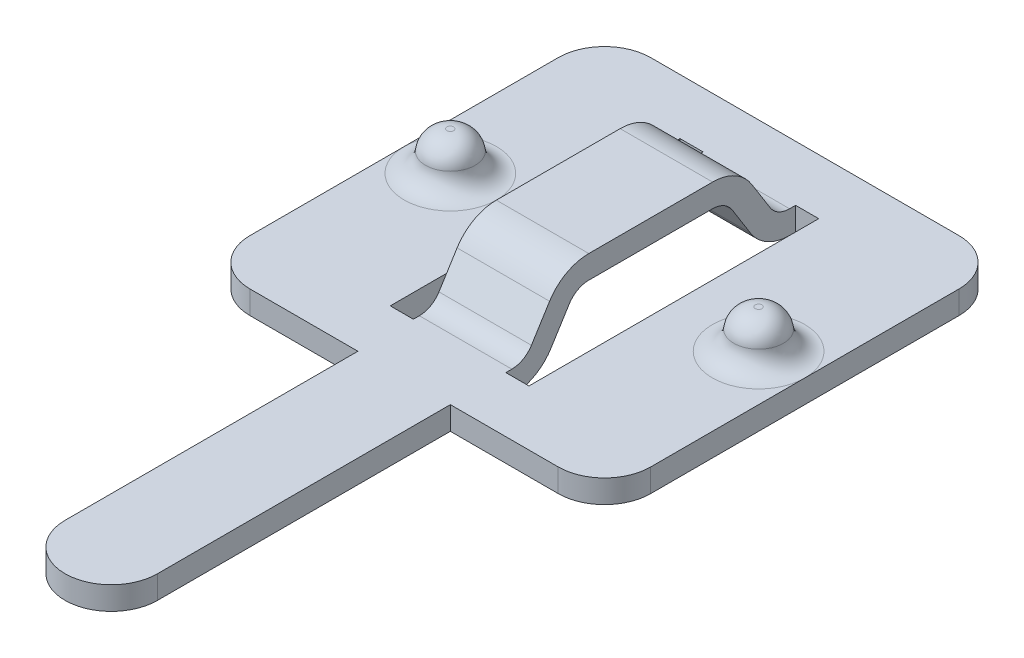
ISO-10303-21;
HEADER;
FILE_DESCRIPTION(('STEP AP214'),'2;1');
FILE_NAME('part.step','',(''),(''),'','','');
FILE_SCHEMA(('AUTOMOTIVE_DESIGN { 1 0 10303 214 1 1 1 1 }'));
ENDSEC;
DATA;
#1=APPLICATION_CONTEXT('core data for automotive mechanical design processes');
#2=APPLICATION_PROTOCOL_DEFINITION('international standard','automotive_design',2000,#1);
#3=PRODUCT_CONTEXT('',#1,'mechanical');
#4=PRODUCT('Part','Part','',(#3));
#5=PRODUCT_RELATED_PRODUCT_CATEGORY('part','',(#4));
#6=PRODUCT_DEFINITION_FORMATION('','',#4);
#7=PRODUCT_DEFINITION_CONTEXT('part definition',#1,'design');
#8=PRODUCT_DEFINITION('design','',#6,#7);
#9=PRODUCT_DEFINITION_SHAPE('','',#8);
#10=(LENGTH_UNIT() NAMED_UNIT(*) SI_UNIT(.MILLI.,.METRE.));
#11=(NAMED_UNIT(*) PLANE_ANGLE_UNIT() SI_UNIT($,.RADIAN.));
#12=(NAMED_UNIT(*) SI_UNIT($,.STERADIAN.) SOLID_ANGLE_UNIT());
#13=UNCERTAINTY_MEASURE_WITH_UNIT(LENGTH_MEASURE(1.E-05),#10,'distance_accuracy_value','');
#14=(GEOMETRIC_REPRESENTATION_CONTEXT(3) GLOBAL_UNCERTAINTY_ASSIGNED_CONTEXT((#13)) GLOBAL_UNIT_ASSIGNED_CONTEXT((#10,
#11,#12)) REPRESENTATION_CONTEXT('',''));
#15=CARTESIAN_POINT('',(0.,0.,0.));
#16=DIRECTION('',(0.,0.,1.));
#17=DIRECTION('',(1.,0.,0.));
#18=AXIS2_PLACEMENT_3D('',#15,#16,#17);
#19=CARTESIAN_POINT('',(2.75,0.75,4.7));
#20=DIRECTION('',(0.,0.,-1.));
#21=DIRECTION('',(-1.,0.,0.));
#22=AXIS2_PLACEMENT_3D('',#19,#20,#21);
#23=PLANE('',#22);
#24=DIRECTION('',(1.,0.,0.));
#25=VECTOR('',#24,1.);
#26=CARTESIAN_POINT('',(2.75,0.,4.7));
#27=LINE('',#26,#25);
#28=CARTESIAN_POINT('',(6.5,0.,4.7));
#29=VERTEX_POINT('',#28);
#30=CARTESIAN_POINT('',(7.25,0.,4.7));
#31=VERTEX_POINT('',#30);
#32=EDGE_CURVE('E52',#29,#31,#27,.T.);
#33=ORIENTED_EDGE('',*,*,#32,.F.);
#34=DIRECTION('',(0.,-1.,0.));
#35=VECTOR('',#34,1.);
#36=CARTESIAN_POINT('',(6.5,0.,4.7));
#37=LINE('',#36,#35);
#38=CARTESIAN_POINT('',(6.5,0.75,4.7));
#39=VERTEX_POINT('',#38);
#40=EDGE_CURVE('E47',#39,#29,#37,.T.);
#41=ORIENTED_EDGE('',*,*,#40,.F.);
#42=DIRECTION('',(1.,0.,0.));
#43=VECTOR('',#42,1.);
#44=CARTESIAN_POINT('',(2.75,0.75,4.7));
#45=LINE('',#44,#43);
#46=CARTESIAN_POINT('',(7.25,0.75,4.7));
#47=VERTEX_POINT('',#46);
#48=EDGE_CURVE('E457',#39,#47,#45,.T.);
#49=ORIENTED_EDGE('',*,*,#48,.T.);
#50=DIRECTION('',(0.,-1.,0.));
#51=VECTOR('',#50,1.);
#52=CARTESIAN_POINT('',(7.25,0.75,4.7));
#53=LINE('',#52,#51);
#54=EDGE_CURVE('E470',#47,#31,#53,.T.);
#55=ORIENTED_EDGE('',*,*,#54,.T.);
#56=EDGE_LOOP('',(#33,#41,#49,#55));
#57=FACE_BOUND('',#56,.T.);
#58=ADVANCED_FACE('F32',(#57),#23,.T.);
#59=CARTESIAN_POINT('',(2.75,0.75,-4.7));
#60=DIRECTION('',(0.,0.,1.));
#61=DIRECTION('',(1.,0.,0.));
#62=AXIS2_PLACEMENT_3D('',#59,#60,#61);
#63=PLANE('',#62);
#64=DIRECTION('',(-1.,0.,0.));
#65=VECTOR('',#64,1.);
#66=CARTESIAN_POINT('',(2.75,0.75,-4.7));
#67=LINE('',#66,#65);
#68=CARTESIAN_POINT('',(7.25,0.75,-4.7));
#69=VERTEX_POINT('',#68);
#70=CARTESIAN_POINT('',(6.5,0.75,-4.7));
#71=VERTEX_POINT('',#70);
#72=EDGE_CURVE('E463',#69,#71,#67,.T.);
#73=ORIENTED_EDGE('',*,*,#72,.T.);
#74=DIRECTION('',(0.,1.,0.));
#75=VECTOR('',#74,1.);
#76=CARTESIAN_POINT('',(6.5,0.75,-4.7));
#77=LINE('',#76,#75);
#78=CARTESIAN_POINT('',(6.5,0.,-4.7));
#79=VERTEX_POINT('',#78);
#80=EDGE_CURVE('E335',#79,#71,#77,.T.);
#81=ORIENTED_EDGE('',*,*,#80,.F.);
#82=DIRECTION('',(-1.,0.,0.));
#83=VECTOR('',#82,1.);
#84=CARTESIAN_POINT('',(2.75,0.,-4.7));
#85=LINE('',#84,#83);
#86=CARTESIAN_POINT('',(7.25,0.,-4.7));
#87=VERTEX_POINT('',#86);
#88=EDGE_CURVE('E452',#87,#79,#85,.T.);
#89=ORIENTED_EDGE('',*,*,#88,.F.);
#90=DIRECTION('',(0.,-1.,0.));
#91=VECTOR('',#90,1.);
#92=CARTESIAN_POINT('',(7.25,0.75,-4.7));
#93=LINE('',#92,#91);
#94=EDGE_CURVE('E468',#69,#87,#93,.T.);
#95=ORIENTED_EDGE('',*,*,#94,.F.);
#96=EDGE_LOOP('',(#73,#81,#89,#95));
#97=FACE_BOUND('',#96,.T.);
#98=ADVANCED_FACE('F601',(#97),#63,.T.);
#99=CARTESIAN_POINT('',(5.,0.75,16.));
#100=DIRECTION('',(0.,1.,0.));
#101=DIRECTION('',(0.,0.,1.));
#102=AXIS2_PLACEMENT_3D('',#99,#100,#101);
#103=PLANE('',#102);
#104=DIRECTION('',(0.,0.,-1.));
#105=VECTOR('',#104,1.);
#106=CARTESIAN_POINT('',(11.5,0.75,-4.99999999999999));
#107=LINE('',#106,#105);
#108=CARTESIAN_POINT('',(11.5,0.75,4.99999999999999));
#109=VERTEX_POINT('',#108);
#110=CARTESIAN_POINT('',(11.5,0.75,0.));
#111=VERTEX_POINT('',#110);
#112=EDGE_CURVE('E518',#109,#111,#107,.T.);
#113=ORIENTED_EDGE('',*,*,#112,.T.);
#114=CARTESIAN_POINT('',(10.,0.75,0.));
#115=DIRECTION('',(0.,-1.,0.));
#116=DIRECTION('',(0.,0.,-1.));
#117=AXIS2_PLACEMENT_3D('',#114,#115,#116);
#118=CIRCLE('',#117,1.5);
#119=EDGE_CURVE('E424',#111,#111,#118,.T.);
#120=ORIENTED_EDGE('',*,*,#119,.T.);
#121=CARTESIAN_POINT('',(11.5,0.75,-4.99999999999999));
#122=VERTEX_POINT('',#121);
#123=EDGE_CURVE('E517',#111,#122,#107,.T.);
#124=ORIENTED_EDGE('',*,*,#123,.T.);
#125=CARTESIAN_POINT('',(10.,0.75,-5.));
#126=DIRECTION('',(0.,1.,0.));
#127=DIRECTION('',(0.,0.,-1.));
#128=AXIS2_PLACEMENT_3D('',#125,#126,#127);
#129=CIRCLE('',#128,1.5);
#130=CARTESIAN_POINT('',(9.99999999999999,0.75,-6.5));
#131=VERTEX_POINT('',#130);
#132=EDGE_CURVE('E520',#122,#131,#129,.T.);
#133=ORIENTED_EDGE('',*,*,#132,.T.);
#134=DIRECTION('',(-1.,0.,0.));
#135=VECTOR('',#134,1.);
#136=CARTESIAN_POINT('',(0.,0.75,-6.5));
#137=LINE('',#136,#135);
#138=CARTESIAN_POINT('',(0.,0.75,-6.5));
#139=VERTEX_POINT('',#138);
#140=EDGE_CURVE('E522',#131,#139,#137,.T.);
#141=ORIENTED_EDGE('',*,*,#140,.T.);
#142=CARTESIAN_POINT('',(0.,0.75,-5.));
#143=DIRECTION('',(0.,1.,0.));
#144=DIRECTION('',(0.,0.,1.));
#145=AXIS2_PLACEMENT_3D('',#142,#143,#144);
#146=CIRCLE('',#145,1.5);
#147=CARTESIAN_POINT('',(-1.5,0.75,-4.99999999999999));
#148=VERTEX_POINT('',#147);
#149=EDGE_CURVE('E524',#139,#148,#146,.T.);
#150=ORIENTED_EDGE('',*,*,#149,.T.);
#151=DIRECTION('',(0.,0.,1.));
#152=VECTOR('',#151,1.);
#153=CARTESIAN_POINT('',(-1.5,0.75,-4.99999999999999));
#154=LINE('',#153,#152);
#155=CARTESIAN_POINT('',(-1.5,0.75,0.));
#156=VERTEX_POINT('',#155);
#157=EDGE_CURVE('E527',#148,#156,#154,.T.);
#158=ORIENTED_EDGE('',*,*,#157,.T.);
#159=CARTESIAN_POINT('',(0.,0.75,0.));
#160=DIRECTION('',(0.,-1.,0.));
#161=DIRECTION('',(0.,0.,-1.));
#162=AXIS2_PLACEMENT_3D('',#159,#160,#161);
#163=CIRCLE('',#162,1.5);
#164=EDGE_CURVE('E436',#156,#156,#163,.T.);
#165=ORIENTED_EDGE('',*,*,#164,.T.);
#166=CARTESIAN_POINT('',(-1.5,0.75,4.99999999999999));
#167=VERTEX_POINT('',#166);
#168=EDGE_CURVE('E526',#156,#167,#154,.T.);
#169=ORIENTED_EDGE('',*,*,#168,.T.);
#170=CARTESIAN_POINT('',(0.,0.75,5.));
#171=DIRECTION('',(0.,1.,0.));
#172=DIRECTION('',(0.,0.,1.));
#173=AXIS2_PLACEMENT_3D('',#170,#171,#172);
#174=CIRCLE('',#173,1.5);
#175=CARTESIAN_POINT('',(0.,0.75,6.5));
#176=VERTEX_POINT('',#175);
#177=EDGE_CURVE('E529',#167,#176,#174,.T.);
#178=ORIENTED_EDGE('',*,*,#177,.T.);
#179=DIRECTION('',(1.,0.,0.));
#180=VECTOR('',#179,1.);
#181=CARTESIAN_POINT('',(0.,0.75,6.5));
#182=LINE('',#181,#180);
#183=CARTESIAN_POINT('',(3.5,0.75,6.5));
#184=VERTEX_POINT('',#183);
#185=EDGE_CURVE('E531',#176,#184,#182,.T.);
#186=ORIENTED_EDGE('',*,*,#185,.T.);
#187=DIRECTION('',(0.,0.,1.));
#188=VECTOR('',#187,1.);
#189=CARTESIAN_POINT('',(3.5,0.75,6.5));
#190=LINE('',#189,#188);
#191=CARTESIAN_POINT('',(3.5,0.75,16.));
#192=VERTEX_POINT('',#191);
#193=EDGE_CURVE('E506',#184,#192,#190,.T.);
#194=ORIENTED_EDGE('',*,*,#193,.T.);
#195=CARTESIAN_POINT('',(5.,0.75,16.));
#196=DIRECTION('',(0.,1.,0.));
#197=DIRECTION('',(0.,0.,1.));
#198=AXIS2_PLACEMENT_3D('',#195,#196,#197);
#199=CIRCLE('',#198,1.5);
#200=CARTESIAN_POINT('',(6.5,0.75,16.));
#201=VERTEX_POINT('',#200);
#202=EDGE_CURVE('E509',#192,#201,#199,.T.);
#203=ORIENTED_EDGE('',*,*,#202,.T.);
#204=DIRECTION('',(0.,0.,-1.));
#205=VECTOR('',#204,1.);
#206=CARTESIAN_POINT('',(6.5,0.75,6.5));
#207=LINE('',#206,#205);
#208=CARTESIAN_POINT('',(6.5,0.75,6.5));
#209=VERTEX_POINT('',#208);
#210=EDGE_CURVE('E511',#201,#209,#207,.T.);
#211=ORIENTED_EDGE('',*,*,#210,.T.);
#212=DIRECTION('',(1.,0.,0.));
#213=VECTOR('',#212,1.);
#214=CARTESIAN_POINT('',(6.5,0.75,6.5));
#215=LINE('',#214,#213);
#216=CARTESIAN_POINT('',(9.99999999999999,0.75,6.5));
#217=VERTEX_POINT('',#216);
#218=EDGE_CURVE('E513',#209,#217,#215,.T.);
#219=ORIENTED_EDGE('',*,*,#218,.T.);
#220=CARTESIAN_POINT('',(10.,0.75,5.));
#221=DIRECTION('',(0.,1.,0.));
#222=DIRECTION('',(0.,0.,1.));
#223=AXIS2_PLACEMENT_3D('',#220,#221,#222);
#224=CIRCLE('',#223,1.5);
#225=EDGE_CURVE('E515',#217,#109,#224,.T.);
#226=ORIENTED_EDGE('',*,*,#225,.T.);
#227=EDGE_LOOP('',(#113,#120,#124,#133,#141,#150,#158,#165,#169,#178,#186,#194,#203,#211,#219,#226));
#228=FACE_BOUND('',#227,.T.);
#229=CARTESIAN_POINT('',(2.75,0.75,4.7));
#230=VERTEX_POINT('',#229);
#231=CARTESIAN_POINT('',(3.5,0.75,4.7));
#232=VERTEX_POINT('',#231);
#233=EDGE_CURVE('E458',#230,#232,#45,.T.);
#234=ORIENTED_EDGE('',*,*,#233,.F.);
#235=DIRECTION('',(0.,0.,1.));
#236=VECTOR('',#235,1.);
#237=CARTESIAN_POINT('',(2.75,0.75,-4.7));
#238=LINE('',#237,#236);
#239=CARTESIAN_POINT('',(2.75,0.75,-4.7));
#240=VERTEX_POINT('',#239);
#241=EDGE_CURVE('E455',#240,#230,#238,.T.);
#242=ORIENTED_EDGE('',*,*,#241,.F.);
#243=CARTESIAN_POINT('',(3.5,0.75,-4.7));
#244=VERTEX_POINT('',#243);
#245=EDGE_CURVE('E278',#244,#240,#67,.T.);
#246=ORIENTED_EDGE('',*,*,#245,.F.);
#247=DIRECTION('',(0.,0.,1.));
#248=VECTOR('',#247,1.);
#249=CARTESIAN_POINT('',(3.5,0.75,-4.50573178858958));
#250=LINE('',#249,#248);
#251=CARTESIAN_POINT('',(3.5,0.75,-4.50573178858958));
#252=VERTEX_POINT('',#251);
#253=EDGE_CURVE('E270',#244,#252,#250,.T.);
#254=ORIENTED_EDGE('',*,*,#253,.T.);
#255=DIRECTION('',(-1.,0.,0.));
#256=VECTOR('',#255,1.);
#257=CARTESIAN_POINT('',(6.5,0.75,-4.50573178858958));
#258=LINE('',#257,#256);
#259=CARTESIAN_POINT('',(6.5,0.75,-4.50573178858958));
#260=VERTEX_POINT('',#259);
#261=EDGE_CURVE('E275',#260,#252,#258,.T.);
#262=ORIENTED_EDGE('',*,*,#261,.F.);
#263=DIRECTION('',(0.,0.,1.));
#264=VECTOR('',#263,1.);
#265=CARTESIAN_POINT('',(6.5,0.75,-4.50573178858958));
#266=LINE('',#265,#264);
#267=EDGE_CURVE('E338',#71,#260,#266,.T.);
#268=ORIENTED_EDGE('',*,*,#267,.F.);
#269=ORIENTED_EDGE('',*,*,#72,.F.);
#270=DIRECTION('',(0.,0.,-1.));
#271=VECTOR('',#270,1.);
#272=CARTESIAN_POINT('',(7.25,0.75,-4.7));
#273=LINE('',#272,#271);
#274=EDGE_CURVE('E460',#47,#69,#273,.T.);
#275=ORIENTED_EDGE('',*,*,#274,.F.);
#276=ORIENTED_EDGE('',*,*,#48,.F.);
#277=DIRECTION('',(0.,0.,1.));
#278=VECTOR('',#277,1.);
#279=CARTESIAN_POINT('',(6.5,0.75,4.7));
#280=LINE('',#279,#278);
#281=CARTESIAN_POINT('',(6.5,0.75,4.50573178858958));
#282=VERTEX_POINT('',#281);
#283=EDGE_CURVE('E353',#282,#39,#280,.T.);
#284=ORIENTED_EDGE('',*,*,#283,.F.);
#285=DIRECTION('',(-1.,0.,0.));
#286=VECTOR('',#285,1.);
#287=CARTESIAN_POINT('',(6.5,0.75,4.50573178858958));
#288=LINE('',#287,#286);
#289=CARTESIAN_POINT('',(3.5,0.75,4.50573178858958));
#290=VERTEX_POINT('',#289);
#291=EDGE_CURVE('E400',#282,#290,#288,.T.);
#292=ORIENTED_EDGE('',*,*,#291,.T.);
#293=DIRECTION('',(0.,0.,1.));
#294=VECTOR('',#293,1.);
#295=CARTESIAN_POINT('',(3.5,0.75,4.7));
#296=LINE('',#295,#294);
#297=EDGE_CURVE('E311',#290,#232,#296,.T.);
#298=ORIENTED_EDGE('',*,*,#297,.T.);
#299=EDGE_LOOP('',(#234,#242,#246,#254,#262,#268,#269,#275,#276,#284,#292,#298));
#300=FACE_BOUND('',#299,.T.);
#301=ADVANCED_FACE('F273',(#228,#300),#103,.T.);
#302=CARTESIAN_POINT('',(5.,0.,16.));
#303=DIRECTION('',(0.,1.,0.));
#304=DIRECTION('',(0.,0.,1.));
#305=AXIS2_PLACEMENT_3D('',#302,#303,#304);
#306=PLANE('',#305);
#307=CARTESIAN_POINT('',(10.,0.,-5.));
#308=DIRECTION('',(0.,1.,0.));
#309=DIRECTION('',(0.,0.,-1.));
#310=AXIS2_PLACEMENT_3D('',#307,#308,#309);
#311=CIRCLE('',#310,1.5);
#312=CARTESIAN_POINT('',(11.5,0.,-4.99999999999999));
#313=VERTEX_POINT('',#312);
#314=CARTESIAN_POINT('',(9.99999999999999,0.,-6.5));
#315=VERTEX_POINT('',#314);
#316=EDGE_CURVE('E494',#313,#315,#311,.T.);
#317=ORIENTED_EDGE('',*,*,#316,.F.);
#318=DIRECTION('',(0.,0.,-1.));
#319=VECTOR('',#318,1.);
#320=CARTESIAN_POINT('',(11.5,0.,-4.99999999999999));
#321=LINE('',#320,#319);
#322=CARTESIAN_POINT('',(11.5,0.,4.99999999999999));
#323=VERTEX_POINT('',#322);
#324=EDGE_CURVE('E492',#323,#313,#321,.T.);
#325=ORIENTED_EDGE('',*,*,#324,.F.);
#326=CARTESIAN_POINT('',(10.,0.,5.));
#327=DIRECTION('',(0.,1.,0.));
#328=DIRECTION('',(0.,0.,1.));
#329=AXIS2_PLACEMENT_3D('',#326,#327,#328);
#330=CIRCLE('',#329,1.5);
#331=CARTESIAN_POINT('',(9.99999999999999,0.,6.5));
#332=VERTEX_POINT('',#331);
#333=EDGE_CURVE('E490',#332,#323,#330,.T.);
#334=ORIENTED_EDGE('',*,*,#333,.F.);
#335=DIRECTION('',(1.,0.,0.));
#336=VECTOR('',#335,1.);
#337=CARTESIAN_POINT('',(6.5,0.,6.5));
#338=LINE('',#337,#336);
#339=CARTESIAN_POINT('',(6.5,0.,6.5));
#340=VERTEX_POINT('',#339);
#341=EDGE_CURVE('E488',#340,#332,#338,.T.);
#342=ORIENTED_EDGE('',*,*,#341,.F.);
#343=DIRECTION('',(0.,0.,-1.));
#344=VECTOR('',#343,1.);
#345=CARTESIAN_POINT('',(6.5,0.,6.5));
#346=LINE('',#345,#344);
#347=CARTESIAN_POINT('',(6.5,0.,16.));
#348=VERTEX_POINT('',#347);
#349=EDGE_CURVE('E486',#348,#340,#346,.T.);
#350=ORIENTED_EDGE('',*,*,#349,.F.);
#351=CARTESIAN_POINT('',(5.,0.,16.));
#352=DIRECTION('',(0.,1.,0.));
#353=DIRECTION('',(0.,0.,1.));
#354=AXIS2_PLACEMENT_3D('',#351,#352,#353);
#355=CIRCLE('',#354,1.5);
#356=CARTESIAN_POINT('',(3.5,0.,16.));
#357=VERTEX_POINT('',#356);
#358=EDGE_CURVE('E484',#357,#348,#355,.T.);
#359=ORIENTED_EDGE('',*,*,#358,.F.);
#360=DIRECTION('',(0.,0.,1.));
#361=VECTOR('',#360,1.);
#362=CARTESIAN_POINT('',(3.5,0.,6.5));
#363=LINE('',#362,#361);
#364=CARTESIAN_POINT('',(3.5,0.,6.5));
#365=VERTEX_POINT('',#364);
#366=EDGE_CURVE('E481',#365,#357,#363,.T.);
#367=ORIENTED_EDGE('',*,*,#366,.F.);
#368=DIRECTION('',(1.,0.,0.));
#369=VECTOR('',#368,1.);
#370=CARTESIAN_POINT('',(0.,0.,6.5));
#371=LINE('',#370,#369);
#372=CARTESIAN_POINT('',(0.,0.,6.5));
#373=VERTEX_POINT('',#372);
#374=EDGE_CURVE('E504',#373,#365,#371,.T.);
#375=ORIENTED_EDGE('',*,*,#374,.F.);
#376=CARTESIAN_POINT('',(0.,0.,5.));
#377=DIRECTION('',(0.,1.,0.));
#378=DIRECTION('',(0.,0.,1.));
#379=AXIS2_PLACEMENT_3D('',#376,#377,#378);
#380=CIRCLE('',#379,1.5);
#381=CARTESIAN_POINT('',(-1.5,0.,4.99999999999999));
#382=VERTEX_POINT('',#381);
#383=EDGE_CURVE('E502',#382,#373,#380,.T.);
#384=ORIENTED_EDGE('',*,*,#383,.F.);
#385=DIRECTION('',(0.,0.,1.));
#386=VECTOR('',#385,1.);
#387=CARTESIAN_POINT('',(-1.5,0.,-4.99999999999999));
#388=LINE('',#387,#386);
#389=CARTESIAN_POINT('',(-1.5,0.,-4.99999999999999));
#390=VERTEX_POINT('',#389);
#391=EDGE_CURVE('E500',#390,#382,#388,.T.);
#392=ORIENTED_EDGE('',*,*,#391,.F.);
#393=CARTESIAN_POINT('',(0.,0.,-5.));
#394=DIRECTION('',(0.,1.,0.));
#395=DIRECTION('',(0.,0.,1.));
#396=AXIS2_PLACEMENT_3D('',#393,#394,#395);
#397=CIRCLE('',#396,1.5);
#398=CARTESIAN_POINT('',(0.,0.,-6.5));
#399=VERTEX_POINT('',#398);
#400=EDGE_CURVE('E498',#399,#390,#397,.T.);
#401=ORIENTED_EDGE('',*,*,#400,.F.);
#402=DIRECTION('',(-1.,0.,0.));
#403=VECTOR('',#402,1.);
#404=CARTESIAN_POINT('',(0.,0.,-6.5));
#405=LINE('',#404,#403);
#406=EDGE_CURVE('E496',#315,#399,#405,.T.);
#407=ORIENTED_EDGE('',*,*,#406,.F.);
#408=EDGE_LOOP('',(#317,#325,#334,#342,#350,#359,#367,#375,#384,#392,#401,#407));
#409=FACE_BOUND('',#408,.T.);
#410=DIRECTION('',(0.,0.,1.));
#411=VECTOR('',#410,1.);
#412=CARTESIAN_POINT('',(2.75,0.,-4.7));
#413=LINE('',#412,#411);
#414=CARTESIAN_POINT('',(2.75,0.,-4.7));
#415=VERTEX_POINT('',#414);
#416=CARTESIAN_POINT('',(2.75,0.,4.7));
#417=VERTEX_POINT('',#416);
#418=EDGE_CURVE('E442',#415,#417,#413,.T.);
#419=ORIENTED_EDGE('',*,*,#418,.T.);
#420=CARTESIAN_POINT('',(3.5,0.,4.7));
#421=VERTEX_POINT('',#420);
#422=EDGE_CURVE('E445',#417,#421,#27,.T.);
#423=ORIENTED_EDGE('',*,*,#422,.T.);
#424=DIRECTION('',(0.,0.,-1.));
#425=VECTOR('',#424,1.);
#426=CARTESIAN_POINT('',(3.5,0.,4.50573178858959));
#427=LINE('',#426,#425);
#428=CARTESIAN_POINT('',(3.5,0.,4.50573178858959));
#429=VERTEX_POINT('',#428);
#430=EDGE_CURVE('E316',#421,#429,#427,.T.);
#431=ORIENTED_EDGE('',*,*,#430,.T.);
#432=DIRECTION('',(-1.,0.,0.));
#433=VECTOR('',#432,1.);
#434=CARTESIAN_POINT('',(6.5,0.,4.50573178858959));
#435=LINE('',#434,#433);
#436=CARTESIAN_POINT('',(6.5,0.,4.50573178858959));
#437=VERTEX_POINT('',#436);
#438=EDGE_CURVE('E397',#437,#429,#435,.T.);
#439=ORIENTED_EDGE('',*,*,#438,.F.);
#440=DIRECTION('',(0.,0.,-1.));
#441=VECTOR('',#440,1.);
#442=CARTESIAN_POINT('',(6.5,0.,4.50573178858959));
#443=LINE('',#442,#441);
#444=EDGE_CURVE('E357',#29,#437,#443,.T.);
#445=ORIENTED_EDGE('',*,*,#444,.F.);
#446=ORIENTED_EDGE('',*,*,#32,.T.);
#447=DIRECTION('',(0.,0.,-1.));
#448=VECTOR('',#447,1.);
#449=CARTESIAN_POINT('',(7.25,0.,-4.7));
#450=LINE('',#449,#448);
#451=EDGE_CURVE('E448',#31,#87,#450,.T.);
#452=ORIENTED_EDGE('',*,*,#451,.T.);
#453=ORIENTED_EDGE('',*,*,#88,.T.);
#454=DIRECTION('',(0.,0.,-1.));
#455=VECTOR('',#454,1.);
#456=CARTESIAN_POINT('',(6.5,0.,-4.7));
#457=LINE('',#456,#455);
#458=CARTESIAN_POINT('',(6.5,0.,-4.50573178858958));
#459=VERTEX_POINT('',#458);
#460=EDGE_CURVE('E373',#459,#79,#457,.T.);
#461=ORIENTED_EDGE('',*,*,#460,.F.);
#462=DIRECTION('',(-1.,0.,0.));
#463=VECTOR('',#462,1.);
#464=CARTESIAN_POINT('',(6.5,0.,-4.50573178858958));
#465=LINE('',#464,#463);
#466=CARTESIAN_POINT('',(3.5,0.,-4.50573178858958));
#467=VERTEX_POINT('',#466);
#468=EDGE_CURVE('E376',#459,#467,#465,.T.);
#469=ORIENTED_EDGE('',*,*,#468,.T.);
#470=DIRECTION('',(0.,0.,-1.));
#471=VECTOR('',#470,1.);
#472=CARTESIAN_POINT('',(3.5,0.,-4.7));
#473=LINE('',#472,#471);
#474=CARTESIAN_POINT('',(3.5,0.,-4.7));
#475=VERTEX_POINT('',#474);
#476=EDGE_CURVE('E332',#467,#475,#473,.T.);
#477=ORIENTED_EDGE('',*,*,#476,.T.);
#478=EDGE_CURVE('E451',#475,#415,#85,.T.);
#479=ORIENTED_EDGE('',*,*,#478,.T.);
#480=EDGE_LOOP('',(#419,#423,#431,#439,#445,#446,#452,#453,#461,#469,#477,#479));
#481=FACE_BOUND('',#480,.T.);
#482=CARTESIAN_POINT('',(0.,0.,0.));
#483=DIRECTION('',(0.,1.,0.));
#484=DIRECTION('',(0.,0.,1.));
#485=AXIS2_PLACEMENT_3D('',#482,#483,#484);
#486=CIRCLE('',#485,1.48);
#487=CARTESIAN_POINT('',(0.,0.,1.48));
#488=VERTEX_POINT('',#487);
#489=EDGE_CURVE('E475',#488,#488,#486,.T.);
#490=ORIENTED_EDGE('',*,*,#489,.T.);
#491=EDGE_LOOP('',(#490));
#492=FACE_BOUND('',#491,.T.);
#493=CARTESIAN_POINT('',(10.,0.,0.));
#494=DIRECTION('',(0.,1.,0.));
#495=DIRECTION('',(0.,0.,1.));
#496=AXIS2_PLACEMENT_3D('',#493,#494,#495);
#497=CIRCLE('',#496,1.48);
#498=CARTESIAN_POINT('',(10.,0.,1.48));
#499=VERTEX_POINT('',#498);
#500=EDGE_CURVE('E478',#499,#499,#497,.T.);
#501=ORIENTED_EDGE('',*,*,#500,.T.);
#502=EDGE_LOOP('',(#501));
#503=FACE_BOUND('',#502,.T.);
#504=ADVANCED_FACE('F582',(#409,#481,#492,#503),#306,.F.);
#505=CARTESIAN_POINT('',(3.5,0.75,6.5));
#506=DIRECTION('',(1.,0.,0.));
#507=DIRECTION('',(0.,0.,-1.));
#508=AXIS2_PLACEMENT_3D('',#505,#506,#507);
#509=PLANE('',#508);
#510=ORIENTED_EDGE('',*,*,#366,.T.);
#511=DIRECTION('',(0.,-1.,0.));
#512=VECTOR('',#511,1.);
#513=CARTESIAN_POINT('',(3.5,0.75,16.));
#514=LINE('',#513,#512);
#515=EDGE_CURVE('E566',#192,#357,#514,.T.);
#516=ORIENTED_EDGE('',*,*,#515,.F.);
#517=ORIENTED_EDGE('',*,*,#193,.F.);
#518=DIRECTION('',(0.,-1.,0.));
#519=VECTOR('',#518,1.);
#520=CARTESIAN_POINT('',(3.5,0.75,6.5));
#521=LINE('',#520,#519);
#522=EDGE_CURVE('E533',#184,#365,#521,.T.);
#523=ORIENTED_EDGE('',*,*,#522,.T.);
#524=EDGE_LOOP('',(#510,#516,#517,#523));
#525=FACE_BOUND('',#524,.T.);
#526=ADVANCED_FACE('F34',(#525),#509,.F.);
#527=CARTESIAN_POINT('',(5.,0.75,16.));
#528=DIRECTION('',(0.,-1.,0.));
#529=DIRECTION('',(0.,0.,-1.));
#530=AXIS2_PLACEMENT_3D('',#527,#528,#529);
#531=CYLINDRICAL_SURFACE('',#530,1.5);
#532=ORIENTED_EDGE('',*,*,#358,.T.);
#533=DIRECTION('',(0.,-1.,0.));
#534=VECTOR('',#533,1.);
#535=CARTESIAN_POINT('',(6.5,0.75,16.));
#536=LINE('',#535,#534);
#537=EDGE_CURVE('E563',#201,#348,#536,.T.);
#538=ORIENTED_EDGE('',*,*,#537,.F.);
#539=ORIENTED_EDGE('',*,*,#202,.F.);
#540=ORIENTED_EDGE('',*,*,#515,.T.);
#541=EDGE_LOOP('',(#532,#538,#539,#540));
#542=FACE_BOUND('',#541,.T.);
#543=ADVANCED_FACE('F996',(#542),#531,.T.);
#544=CARTESIAN_POINT('',(6.5,0.75,6.5));
#545=DIRECTION('',(-1.,0.,0.));
#546=DIRECTION('',(0.,0.,1.));
#547=AXIS2_PLACEMENT_3D('',#544,#545,#546);
#548=PLANE('',#547);
#549=ORIENTED_EDGE('',*,*,#349,.T.);
#550=DIRECTION('',(0.,-1.,0.));
#551=VECTOR('',#550,1.);
#552=CARTESIAN_POINT('',(6.5,0.75,6.5));
#553=LINE('',#552,#551);
#554=EDGE_CURVE('E560',#209,#340,#553,.T.);
#555=ORIENTED_EDGE('',*,*,#554,.F.);
#556=ORIENTED_EDGE('',*,*,#210,.F.);
#557=ORIENTED_EDGE('',*,*,#537,.T.);
#558=EDGE_LOOP('',(#549,#555,#556,#557));
#559=FACE_BOUND('',#558,.T.);
#560=ADVANCED_FACE('F1004',(#559),#548,.F.);
#561=CARTESIAN_POINT('',(6.5,0.75,6.5));
#562=DIRECTION('',(0.,0.,-1.));
#563=DIRECTION('',(-1.,0.,0.));
#564=AXIS2_PLACEMENT_3D('',#561,#562,#563);
#565=PLANE('',#564);
#566=ORIENTED_EDGE('',*,*,#341,.T.);
#567=DIRECTION('',(0.,-1.,0.));
#568=VECTOR('',#567,1.);
#569=CARTESIAN_POINT('',(9.99999999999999,0.75,6.5));
#570=LINE('',#569,#568);
#571=EDGE_CURVE('E557',#217,#332,#570,.T.);
#572=ORIENTED_EDGE('',*,*,#571,.F.);
#573=ORIENTED_EDGE('',*,*,#218,.F.);
#574=ORIENTED_EDGE('',*,*,#554,.T.);
#575=EDGE_LOOP('',(#566,#572,#573,#574));
#576=FACE_BOUND('',#575,.T.);
#577=ADVANCED_FACE('F1012',(#576),#565,.F.);
#578=CARTESIAN_POINT('',(10.,0.75,5.));
#579=DIRECTION('',(0.,-1.,0.));
#580=DIRECTION('',(0.,0.,-1.));
#581=AXIS2_PLACEMENT_3D('',#578,#579,#580);
#582=CYLINDRICAL_SURFACE('',#581,1.5);
#583=ORIENTED_EDGE('',*,*,#333,.T.);
#584=DIRECTION('',(0.,-1.,0.));
#585=VECTOR('',#584,1.);
#586=CARTESIAN_POINT('',(11.5,0.75,4.99999999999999));
#587=LINE('',#586,#585);
#588=EDGE_CURVE('E554',#109,#323,#587,.T.);
#589=ORIENTED_EDGE('',*,*,#588,.F.);
#590=ORIENTED_EDGE('',*,*,#225,.F.);
#591=ORIENTED_EDGE('',*,*,#571,.T.);
#592=EDGE_LOOP('',(#583,#589,#590,#591));
#593=FACE_BOUND('',#592,.T.);
#594=ADVANCED_FACE('F1021',(#593),#582,.T.);
#595=CARTESIAN_POINT('',(11.5,0.75,-4.99999999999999));
#596=DIRECTION('',(-1.,0.,0.));
#597=DIRECTION('',(0.,0.,1.));
#598=AXIS2_PLACEMENT_3D('',#595,#596,#597);
#599=PLANE('',#598);
#600=ORIENTED_EDGE('',*,*,#123,.F.);
#601=ORIENTED_EDGE('',*,*,#112,.F.);
#602=ORIENTED_EDGE('',*,*,#588,.T.);
#603=ORIENTED_EDGE('',*,*,#324,.T.);
#604=DIRECTION('',(0.,-1.,0.));
#605=VECTOR('',#604,1.);
#606=CARTESIAN_POINT('',(11.5,0.75,-4.99999999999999));
#607=LINE('',#606,#605);
#608=EDGE_CURVE('E551',#122,#313,#607,.T.);
#609=ORIENTED_EDGE('',*,*,#608,.F.);
#610=EDGE_LOOP('',(#600,#601,#602,#603,#609));
#611=FACE_BOUND('',#610,.T.);
#612=ADVANCED_FACE('F1030',(#611),#599,.F.);
#613=CARTESIAN_POINT('',(10.,0.75,-5.));
#614=DIRECTION('',(0.,-1.,0.));
#615=DIRECTION('',(0.,0.,-1.));
#616=AXIS2_PLACEMENT_3D('',#613,#614,#615);
#617=CYLINDRICAL_SURFACE('',#616,1.5);
#618=ORIENTED_EDGE('',*,*,#316,.T.);
#619=DIRECTION('',(0.,-1.,0.));
#620=VECTOR('',#619,1.);
#621=CARTESIAN_POINT('',(9.99999999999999,0.75,-6.5));
#622=LINE('',#621,#620);
#623=EDGE_CURVE('E548',#131,#315,#622,.T.);
#624=ORIENTED_EDGE('',*,*,#623,.F.);
#625=ORIENTED_EDGE('',*,*,#132,.F.);
#626=ORIENTED_EDGE('',*,*,#608,.T.);
#627=EDGE_LOOP('',(#618,#624,#625,#626));
#628=FACE_BOUND('',#627,.T.);
#629=ADVANCED_FACE('F1039',(#628),#617,.T.);
#630=CARTESIAN_POINT('',(0.,0.75,-6.5));
#631=DIRECTION('',(0.,0.,1.));
#632=DIRECTION('',(1.,0.,0.));
#633=AXIS2_PLACEMENT_3D('',#630,#631,#632);
#634=PLANE('',#633);
#635=ORIENTED_EDGE('',*,*,#406,.T.);
#636=DIRECTION('',(0.,-1.,0.));
#637=VECTOR('',#636,1.);
#638=CARTESIAN_POINT('',(0.,0.75,-6.5));
#639=LINE('',#638,#637);
#640=EDGE_CURVE('E545',#139,#399,#639,.T.);
#641=ORIENTED_EDGE('',*,*,#640,.F.);
#642=ORIENTED_EDGE('',*,*,#140,.F.);
#643=ORIENTED_EDGE('',*,*,#623,.T.);
#644=EDGE_LOOP('',(#635,#641,#642,#643));
#645=FACE_BOUND('',#644,.T.);
#646=ADVANCED_FACE('F1047',(#645),#634,.F.);
#647=CARTESIAN_POINT('',(0.,0.75,-5.));
#648=DIRECTION('',(0.,-1.,0.));
#649=DIRECTION('',(0.,0.,-1.));
#650=AXIS2_PLACEMENT_3D('',#647,#648,#649);
#651=CYLINDRICAL_SURFACE('',#650,1.5);
#652=ORIENTED_EDGE('',*,*,#400,.T.);
#653=DIRECTION('',(0.,-1.,0.));
#654=VECTOR('',#653,1.);
#655=CARTESIAN_POINT('',(-1.5,0.75,-4.99999999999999));
#656=LINE('',#655,#654);
#657=EDGE_CURVE('E542',#148,#390,#656,.T.);
#658=ORIENTED_EDGE('',*,*,#657,.F.);
#659=ORIENTED_EDGE('',*,*,#149,.F.);
#660=ORIENTED_EDGE('',*,*,#640,.T.);
#661=EDGE_LOOP('',(#652,#658,#659,#660));
#662=FACE_BOUND('',#661,.T.);
#663=ADVANCED_FACE('F1056',(#662),#651,.T.);
#664=CARTESIAN_POINT('',(-1.5,0.75,-4.99999999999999));
#665=DIRECTION('',(1.,0.,0.));
#666=DIRECTION('',(0.,0.,-1.));
#667=AXIS2_PLACEMENT_3D('',#664,#665,#666);
#668=PLANE('',#667);
#669=ORIENTED_EDGE('',*,*,#168,.F.);
#670=ORIENTED_EDGE('',*,*,#157,.F.);
#671=ORIENTED_EDGE('',*,*,#657,.T.);
#672=ORIENTED_EDGE('',*,*,#391,.T.);
#673=DIRECTION('',(0.,-1.,0.));
#674=VECTOR('',#673,1.);
#675=CARTESIAN_POINT('',(-1.5,0.75,4.99999999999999));
#676=LINE('',#675,#674);
#677=EDGE_CURVE('E539',#167,#382,#676,.T.);
#678=ORIENTED_EDGE('',*,*,#677,.F.);
#679=EDGE_LOOP('',(#669,#670,#671,#672,#678));
#680=FACE_BOUND('',#679,.T.);
#681=ADVANCED_FACE('F1065',(#680),#668,.F.);
#682=CARTESIAN_POINT('',(0.,0.75,5.));
#683=DIRECTION('',(0.,-1.,0.));
#684=DIRECTION('',(0.,0.,-1.));
#685=AXIS2_PLACEMENT_3D('',#682,#683,#684);
#686=CYLINDRICAL_SURFACE('',#685,1.5);
#687=ORIENTED_EDGE('',*,*,#383,.T.);
#688=DIRECTION('',(0.,-1.,0.));
#689=VECTOR('',#688,1.);
#690=CARTESIAN_POINT('',(0.,0.75,6.5));
#691=LINE('',#690,#689);
#692=EDGE_CURVE('E536',#176,#373,#691,.T.);
#693=ORIENTED_EDGE('',*,*,#692,.F.);
#694=ORIENTED_EDGE('',*,*,#177,.F.);
#695=ORIENTED_EDGE('',*,*,#677,.T.);
#696=EDGE_LOOP('',(#687,#693,#694,#695));
#697=FACE_BOUND('',#696,.T.);
#698=ADVANCED_FACE('F596',(#697),#686,.T.);
#699=CARTESIAN_POINT('',(0.,0.75,6.5));
#700=DIRECTION('',(0.,0.,-1.));
#701=DIRECTION('',(-1.,0.,0.));
#702=AXIS2_PLACEMENT_3D('',#699,#700,#701);
#703=PLANE('',#702);
#704=ORIENTED_EDGE('',*,*,#374,.T.);
#705=ORIENTED_EDGE('',*,*,#522,.F.);
#706=ORIENTED_EDGE('',*,*,#185,.F.);
#707=ORIENTED_EDGE('',*,*,#692,.T.);
#708=EDGE_LOOP('',(#704,#705,#706,#707));
#709=FACE_BOUND('',#708,.T.);
#710=ADVANCED_FACE('F590',(#709),#703,.F.);
#711=CARTESIAN_POINT('',(10.,0.75,0.));
#712=DIRECTION('',(0.,-1.,0.));
#713=DIRECTION('',(0.,0.,-1.));
#714=AXIS2_PLACEMENT_3D('',#711,#712,#713);
#715=CYLINDRICAL_SURFACE('',#714,1.48);
#716=CARTESIAN_POINT('',(10.,0.000137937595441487,0.));
#717=DIRECTION('',(0.,1.,0.));
#718=DIRECTION('',(0.,0.,1.));
#719=AXIS2_PLACEMENT_3D('',#716,#717,#718);
#720=CIRCLE('',#719,1.48);
#721=CARTESIAN_POINT('',(10.,0.000137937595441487,1.48));
#722=VERTEX_POINT('',#721);
#723=EDGE_CURVE('E11',#722,#722,#720,.F.);
#724=ORIENTED_EDGE('',*,*,#723,.F.);
#725=EDGE_LOOP('',(#724));
#726=FACE_BOUND('',#725,.T.);
#727=ORIENTED_EDGE('',*,*,#500,.F.);
#728=EDGE_LOOP('',(#727));
#729=FACE_BOUND('',#728,.T.);
#730=ADVANCED_FACE('F578',(#726,#729),#715,.F.);
#731=CARTESIAN_POINT('',(0.,0.75,0.));
#732=DIRECTION('',(0.,-1.,0.));
#733=DIRECTION('',(0.,0.,-1.));
#734=AXIS2_PLACEMENT_3D('',#731,#732,#733);
#735=CYLINDRICAL_SURFACE('',#734,1.48);
#736=CARTESIAN_POINT('',(0.,0.000137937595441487,0.));
#737=DIRECTION('',(0.,1.,0.));
#738=DIRECTION('',(0.,0.,1.));
#739=AXIS2_PLACEMENT_3D('',#736,#737,#738);
#740=CIRCLE('',#739,1.48);
#741=CARTESIAN_POINT('',(0.,0.000137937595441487,1.48));
#742=VERTEX_POINT('',#741);
#743=EDGE_CURVE('E40',#742,#742,#740,.F.);
#744=ORIENTED_EDGE('',*,*,#743,.F.);
#745=EDGE_LOOP('',(#744));
#746=FACE_BOUND('',#745,.T.);
#747=ORIENTED_EDGE('',*,*,#489,.F.);
#748=EDGE_LOOP('',(#747));
#749=FACE_BOUND('',#748,.T.);
#750=ADVANCED_FACE('F574',(#746,#749),#735,.F.);
#751=CARTESIAN_POINT('',(2.75,0.75,-4.7));
#752=DIRECTION('',(1.,0.,0.));
#753=DIRECTION('',(0.,0.,-1.));
#754=AXIS2_PLACEMENT_3D('',#751,#752,#753);
#755=PLANE('',#754);
#756=ORIENTED_EDGE('',*,*,#418,.F.);
#757=DIRECTION('',(0.,-1.,0.));
#758=VECTOR('',#757,1.);
#759=CARTESIAN_POINT('',(2.75,0.75,-4.7));
#760=LINE('',#759,#758);
#761=EDGE_CURVE('E465',#240,#415,#760,.T.);
#762=ORIENTED_EDGE('',*,*,#761,.F.);
#763=ORIENTED_EDGE('',*,*,#241,.T.);
#764=DIRECTION('',(0.,-1.,0.));
#765=VECTOR('',#764,1.);
#766=CARTESIAN_POINT('',(2.75,0.75,4.7));
#767=LINE('',#766,#765);
#768=EDGE_CURVE('E472',#230,#417,#767,.T.);
#769=ORIENTED_EDGE('',*,*,#768,.T.);
#770=EDGE_LOOP('',(#756,#762,#763,#769));
#771=FACE_BOUND('',#770,.T.);
#772=ADVANCED_FACE('F577',(#771),#755,.T.);
#773=DIRECTION('',(0.,-1.,0.));
#774=VECTOR('',#773,1.);
#775=CARTESIAN_POINT('',(3.5,0.,4.7));
#776=LINE('',#775,#774);
#777=EDGE_CURVE('E314',#232,#421,#776,.T.);
#778=ORIENTED_EDGE('',*,*,#777,.T.);
#779=ORIENTED_EDGE('',*,*,#422,.F.);
#780=ORIENTED_EDGE('',*,*,#768,.F.);
#781=ORIENTED_EDGE('',*,*,#233,.T.);
#782=EDGE_LOOP('',(#778,#779,#780,#781));
#783=FACE_BOUND('',#782,.T.);
#784=ADVANCED_FACE('F603',(#783),#23,.T.);
#785=CARTESIAN_POINT('',(7.25,0.75,-4.7));
#786=DIRECTION('',(-1.,0.,0.));
#787=DIRECTION('',(0.,0.,1.));
#788=AXIS2_PLACEMENT_3D('',#785,#786,#787);
#789=PLANE('',#788);
#790=ORIENTED_EDGE('',*,*,#451,.F.);
#791=ORIENTED_EDGE('',*,*,#54,.F.);
#792=ORIENTED_EDGE('',*,*,#274,.T.);
#793=ORIENTED_EDGE('',*,*,#94,.T.);
#794=EDGE_LOOP('',(#790,#791,#792,#793));
#795=FACE_BOUND('',#794,.T.);
#796=ADVANCED_FACE('F613',(#795),#789,.T.);
#797=DIRECTION('',(0.,1.,0.));
#798=VECTOR('',#797,1.);
#799=CARTESIAN_POINT('',(3.5,0.75,-4.7));
#800=LINE('',#799,#798);
#801=EDGE_CURVE('E283',#475,#244,#800,.T.);
#802=ORIENTED_EDGE('',*,*,#801,.T.);
#803=ORIENTED_EDGE('',*,*,#245,.T.);
#804=ORIENTED_EDGE('',*,*,#761,.T.);
#805=ORIENTED_EDGE('',*,*,#478,.F.);
#806=EDGE_LOOP('',(#802,#803,#804,#805));
#807=FACE_BOUND('',#806,.T.);
#808=ADVANCED_FACE('F609',(#807),#63,.T.);
#809=CARTESIAN_POINT('',(0.,0.65,0.));
#810=DIRECTION('',(0.,-1.,0.));
#811=DIRECTION('',(1.,0.,0.));
#812=AXIS2_PLACEMENT_3D('',#809,#810,#811);
#813=SPHERICAL_SURFACE('',#812,0.25);
#814=CARTESIAN_POINT('',(0.,0.76764705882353,0.));
#815=DIRECTION('',(0.,-1.,0.));
#816=DIRECTION('',(0.,0.,-1.));
#817=AXIS2_PLACEMENT_3D('',#814,#815,#816);
#818=CIRCLE('',#817,0.220588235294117);
#819=CARTESIAN_POINT('',(0.,0.76764705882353,-0.220588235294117));
#820=VERTEX_POINT('',#819);
#821=EDGE_CURVE('E439',#820,#820,#818,.T.);
#822=ORIENTED_EDGE('',*,*,#821,.T.);
#823=EDGE_LOOP('',(#822));
#824=FACE_BOUND('',#823,.T.);
#825=ADVANCED_FACE('F734',(#824),#813,.F.);
#826=CARTESIAN_POINT('',(0.,1.45,0.));
#827=DIRECTION('',(0.,-1.,0.));
#828=DIRECTION('',(0.,0.,-1.));
#829=AXIS2_PLACEMENT_3D('',#826,#827,#828);
#830=TOROIDAL_SURFACE('',#829,1.5,1.45);
#831=ORIENTED_EDGE('',*,*,#743,.T.);
#832=EDGE_LOOP('',(#831));
#833=FACE_BOUND('',#832,.T.);
#834=ORIENTED_EDGE('',*,*,#821,.F.);
#835=EDGE_LOOP('',(#834));
#836=FACE_BOUND('',#835,.T.);
#837=ADVANCED_FACE('F571',(#833,#836),#830,.T.);
#838=CARTESIAN_POINT('',(0.,1.45,0.));
#839=DIRECTION('',(0.,-1.,0.));
#840=DIRECTION('',(0.,0.,-1.));
#841=AXIS2_PLACEMENT_3D('',#838,#839,#840);
#842=TOROIDAL_SURFACE('',#841,1.5,0.7);
#843=CARTESIAN_POINT('',(0.,1.375,0.));
#844=DIRECTION('',(0.,-1.,0.));
#845=DIRECTION('',(0.,0.,-1.));
#846=AXIS2_PLACEMENT_3D('',#843,#844,#845);
#847=CIRCLE('',#846,0.804029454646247);
#848=CARTESIAN_POINT('',(0.,1.375,-0.804029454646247));
#849=VERTEX_POINT('',#848);
#850=EDGE_CURVE('E433',#849,#849,#847,.T.);
#851=ORIENTED_EDGE('',*,*,#850,.T.);
#852=EDGE_LOOP('',(#851));
#853=FACE_BOUND('',#852,.T.);
#854=ORIENTED_EDGE('',*,*,#164,.F.);
#855=EDGE_LOOP('',(#854));
#856=FACE_BOUND('',#855,.T.);
#857=ADVANCED_FACE('F727',(#853,#856),#842,.F.);
#858=CARTESIAN_POINT('',(0.,1.3,0.));
#859=DIRECTION('',(0.,-1.,0.));
#860=DIRECTION('',(0.,0.,-1.));
#861=AXIS2_PLACEMENT_3D('',#858,#859,#860);
#862=DEGENERATE_TOROIDAL_SURFACE('',#861,0.108058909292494,0.7,.T.);
#863=CARTESIAN_POINT('',(0.,2.,0.));
#864=DIRECTION('',(0.,-1.,0.));
#865=DIRECTION('',(0.,0.,-1.));
#866=AXIS2_PLACEMENT_3D('',#863,#864,#865);
#867=CIRCLE('',#866,0.108058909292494);
#868=CARTESIAN_POINT('',(0.,2.,-0.108058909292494));
#869=VERTEX_POINT('',#868);
#870=EDGE_CURVE('E430',#869,#869,#867,.T.);
#871=ORIENTED_EDGE('',*,*,#870,.T.);
#872=EDGE_LOOP('',(#871));
#873=FACE_BOUND('',#872,.T.);
#874=ORIENTED_EDGE('',*,*,#850,.F.);
#875=EDGE_LOOP('',(#874));
#876=FACE_BOUND('',#875,.T.);
#877=ADVANCED_FACE('F723',(#873,#876),#862,.T.);
#878=CARTESIAN_POINT('',(0.,2.,0.));
#879=DIRECTION('',(0.,1.,0.));
#880=DIRECTION('',(0.,0.,1.));
#881=AXIS2_PLACEMENT_3D('',#878,#879,#880);
#882=PLANE('',#881);
#883=ORIENTED_EDGE('',*,*,#870,.F.);
#884=EDGE_LOOP('',(#883));
#885=FACE_BOUND('',#884,.T.);
#886=ADVANCED_FACE('F719',(#885),#882,.T.);
#887=CARTESIAN_POINT('',(10.,0.65,0.));
#888=DIRECTION('',(0.,-1.,0.));
#889=DIRECTION('',(1.,0.,0.));
#890=AXIS2_PLACEMENT_3D('',#887,#888,#889);
#891=SPHERICAL_SURFACE('',#890,0.25);
#892=CARTESIAN_POINT('',(10.,0.76764705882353,0.));
#893=DIRECTION('',(0.,-1.,0.));
#894=DIRECTION('',(0.,0.,-1.));
#895=AXIS2_PLACEMENT_3D('',#892,#893,#894);
#896=CIRCLE('',#895,0.220588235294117);
#897=CARTESIAN_POINT('',(10.,0.76764705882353,-0.22058823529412));
#898=VERTEX_POINT('',#897);
#899=EDGE_CURVE('E427',#898,#898,#896,.T.);
#900=ORIENTED_EDGE('',*,*,#899,.T.);
#901=EDGE_LOOP('',(#900));
#902=FACE_BOUND('',#901,.T.);
#903=ADVANCED_FACE('F715',(#902),#891,.F.);
#904=CARTESIAN_POINT('',(10.,1.45,0.));
#905=DIRECTION('',(0.,-1.,0.));
#906=DIRECTION('',(0.,0.,-1.));
#907=AXIS2_PLACEMENT_3D('',#904,#905,#906);
#908=TOROIDAL_SURFACE('',#907,1.5,1.45);
#909=ORIENTED_EDGE('',*,*,#723,.T.);
#910=EDGE_LOOP('',(#909));
#911=FACE_BOUND('',#910,.T.);
#912=ORIENTED_EDGE('',*,*,#899,.F.);
#913=EDGE_LOOP('',(#912));
#914=FACE_BOUND('',#913,.T.);
#915=ADVANCED_FACE('F711',(#911,#914),#908,.T.);
#916=CARTESIAN_POINT('',(10.,1.45,0.));
#917=DIRECTION('',(0.,-1.,0.));
#918=DIRECTION('',(0.,0.,-1.));
#919=AXIS2_PLACEMENT_3D('',#916,#917,#918);
#920=TOROIDAL_SURFACE('',#919,1.5,0.7);
#921=CARTESIAN_POINT('',(10.,1.375,0.));
#922=DIRECTION('',(0.,-1.,0.));
#923=DIRECTION('',(0.,0.,-1.));
#924=AXIS2_PLACEMENT_3D('',#921,#922,#923);
#925=CIRCLE('',#924,0.804029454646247);
#926=CARTESIAN_POINT('',(10.,1.375,-0.80402945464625));
#927=VERTEX_POINT('',#926);
#928=EDGE_CURVE('E421',#927,#927,#925,.T.);
#929=ORIENTED_EDGE('',*,*,#928,.T.);
#930=EDGE_LOOP('',(#929));
#931=FACE_BOUND('',#930,.T.);
#932=ORIENTED_EDGE('',*,*,#119,.F.);
#933=EDGE_LOOP('',(#932));
#934=FACE_BOUND('',#933,.T.);
#935=ADVANCED_FACE('F707',(#931,#934),#920,.F.);
#936=CARTESIAN_POINT('',(10.,1.3,0.));
#937=DIRECTION('',(0.,-1.,0.));
#938=DIRECTION('',(0.,0.,-1.));
#939=AXIS2_PLACEMENT_3D('',#936,#937,#938);
#940=DEGENERATE_TOROIDAL_SURFACE('',#939,0.108058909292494,0.7,.T.);
#941=CARTESIAN_POINT('',(10.,2.,0.));
#942=DIRECTION('',(0.,-1.,0.));
#943=DIRECTION('',(0.,0.,-1.));
#944=AXIS2_PLACEMENT_3D('',#941,#942,#943);
#945=CIRCLE('',#944,0.108058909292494);
#946=CARTESIAN_POINT('',(10.,2.,-0.108058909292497));
#947=VERTEX_POINT('',#946);
#948=EDGE_CURVE('E290',#947,#947,#945,.T.);
#949=ORIENTED_EDGE('',*,*,#948,.T.);
#950=EDGE_LOOP('',(#949));
#951=FACE_BOUND('',#950,.T.);
#952=ORIENTED_EDGE('',*,*,#928,.F.);
#953=EDGE_LOOP('',(#952));
#954=FACE_BOUND('',#953,.T.);
#955=ADVANCED_FACE('F703',(#951,#954),#940,.T.);
#956=CARTESIAN_POINT('',(10.,2.,0.));
#957=DIRECTION('',(0.,1.,0.));
#958=DIRECTION('',(0.,0.,1.));
#959=AXIS2_PLACEMENT_3D('',#956,#957,#958);
#960=PLANE('',#959);
#961=ORIENTED_EDGE('',*,*,#948,.F.);
#962=EDGE_LOOP('',(#961));
#963=FACE_BOUND('',#962,.T.);
#964=ADVANCED_FACE('F697',(#963),#960,.T.);
#965=CARTESIAN_POINT('',(6.5,1.5,-4.50573178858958));
#966=DIRECTION('',(-1.,0.,0.));
#967=DIRECTION('',(0.,0.,1.));
#968=AXIS2_PLACEMENT_3D('',#965,#966,#967);
#969=CYLINDRICAL_SURFACE('',#968,0.75);
#970=CARTESIAN_POINT('',(3.5,1.5,-4.50573178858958));
#971=DIRECTION('',(-1.,0.,0.));
#972=DIRECTION('',(0.,0.,-1.));
#973=AXIS2_PLACEMENT_3D('',#970,#971,#972);
#974=CIRCLE('',#973,0.75);
#975=CARTESIAN_POINT('',(3.5,1.1025605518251,-3.86969571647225));
#976=VERTEX_POINT('',#975);
#977=EDGE_CURVE('E282',#252,#976,#974,.T.);
#978=ORIENTED_EDGE('',*,*,#977,.T.);
#979=DIRECTION('',(-1.,0.,0.));
#980=VECTOR('',#979,1.);
#981=CARTESIAN_POINT('',(6.5,1.1025605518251,-3.86969571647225));
#982=LINE('',#981,#980);
#983=CARTESIAN_POINT('',(6.5,1.1025605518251,-3.86969571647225));
#984=VERTEX_POINT('',#983);
#985=EDGE_CURVE('E291',#984,#976,#982,.T.);
#986=ORIENTED_EDGE('',*,*,#985,.F.);
#987=CARTESIAN_POINT('',(6.5,1.5,-4.50573178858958));
#988=DIRECTION('',(-1.,0.,0.));
#989=DIRECTION('',(0.,0.,-1.));
#990=AXIS2_PLACEMENT_3D('',#987,#988,#989);
#991=CIRCLE('',#990,0.75);
#992=EDGE_CURVE('E289',#260,#984,#991,.T.);
#993=ORIENTED_EDGE('',*,*,#992,.F.);
#994=ORIENTED_EDGE('',*,*,#261,.T.);
#995=EDGE_LOOP('',(#978,#986,#993,#994));
#996=FACE_BOUND('',#995,.T.);
#997=ADVANCED_FACE('F286',(#996),#969,.F.);
#998=CARTESIAN_POINT('',(6.5,2.0448788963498,-3.28086986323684));
#999=DIRECTION('',(0.,-0.529919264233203,0.848048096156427));
#1000=DIRECTION('',(0.,-0.848048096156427,-0.529919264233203));
#1001=AXIS2_PLACEMENT_3D('',#998,#999,#1000);
#1002=PLANE('',#1001);
#1003=DIRECTION('',(0.,0.848048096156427,0.529919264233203));
#1004=VECTOR('',#1003,1.);
#1005=CARTESIAN_POINT('',(3.5,2.0448788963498,-3.28086986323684));
#1006=LINE('',#1005,#1004);
#1007=CARTESIAN_POINT('',(3.5,2.0448788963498,-3.28086986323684));
#1008=VERTEX_POINT('',#1007);
#1009=EDGE_CURVE('E296',#976,#1008,#1006,.T.);
#1010=ORIENTED_EDGE('',*,*,#1009,.T.);
#1011=DIRECTION('',(-1.,0.,0.));
#1012=VECTOR('',#1011,1.);
#1013=CARTESIAN_POINT('',(6.5,2.0448788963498,-3.28086986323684));
#1014=LINE('',#1013,#1012);
#1015=CARTESIAN_POINT('',(6.5,2.0448788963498,-3.28086986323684));
#1016=VERTEX_POINT('',#1015);
#1017=EDGE_CURVE('E415',#1016,#1008,#1014,.T.);
#1018=ORIENTED_EDGE('',*,*,#1017,.F.);
#1019=DIRECTION('',(0.,0.848048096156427,0.529919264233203));
#1020=VECTOR('',#1019,1.);
#1021=CARTESIAN_POINT('',(6.5,2.0448788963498,-3.28086986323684));
#1022=LINE('',#1021,#1020);
#1023=EDGE_CURVE('E341',#984,#1016,#1022,.T.);
#1024=ORIENTED_EDGE('',*,*,#1023,.F.);
#1025=ORIENTED_EDGE('',*,*,#985,.T.);
#1026=EDGE_LOOP('',(#1010,#1018,#1024,#1025));
#1027=FACE_BOUND('',#1026,.T.);
#1028=ADVANCED_FACE('F689',(#1027),#1002,.F.);
#1029=CARTESIAN_POINT('',(6.5,1.25,-2.00879771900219));
#1030=DIRECTION('',(-1.,0.,0.));
#1031=DIRECTION('',(0.,0.,1.));
#1032=AXIS2_PLACEMENT_3D('',#1029,#1030,#1031);
#1033=CYLINDRICAL_SURFACE('',#1032,1.5);
#1034=CARTESIAN_POINT('',(3.5,1.25,-2.0087977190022));
#1035=DIRECTION('',(1.,0.,0.));
#1036=DIRECTION('',(0.,0.,1.));
#1037=AXIS2_PLACEMENT_3D('',#1034,#1035,#1036);
#1038=CIRCLE('',#1037,1.5);
#1039=CARTESIAN_POINT('',(3.5,2.75,-2.00879771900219));
#1040=VERTEX_POINT('',#1039);
#1041=EDGE_CURVE('E298',#1008,#1040,#1038,.T.);
#1042=ORIENTED_EDGE('',*,*,#1041,.T.);
#1043=DIRECTION('',(-1.,0.,0.));
#1044=VECTOR('',#1043,1.);
#1045=CARTESIAN_POINT('',(6.5,2.75,-2.00879771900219));
#1046=LINE('',#1045,#1044);
#1047=CARTESIAN_POINT('',(6.5,2.75,-2.00879771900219));
#1048=VERTEX_POINT('',#1047);
#1049=EDGE_CURVE('E412',#1048,#1040,#1046,.T.);
#1050=ORIENTED_EDGE('',*,*,#1049,.F.);
#1051=CARTESIAN_POINT('',(6.5,1.25,-2.00879771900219));
#1052=DIRECTION('',(1.,0.,0.));
#1053=DIRECTION('',(0.,0.,1.));
#1054=AXIS2_PLACEMENT_3D('',#1051,#1052,#1053);
#1055=CIRCLE('',#1054,1.5);
#1056=EDGE_CURVE('E343',#1016,#1048,#1055,.T.);
#1057=ORIENTED_EDGE('',*,*,#1056,.F.);
#1058=ORIENTED_EDGE('',*,*,#1017,.T.);
#1059=EDGE_LOOP('',(#1042,#1050,#1057,#1058));
#1060=FACE_BOUND('',#1059,.T.);
#1061=ADVANCED_FACE('F685',(#1060),#1033,.T.);
#1062=CARTESIAN_POINT('',(6.5,2.75,2.00879771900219));
#1063=DIRECTION('',(0.,-1.,0.));
#1064=DIRECTION('',(0.,0.,-1.));
#1065=AXIS2_PLACEMENT_3D('',#1062,#1063,#1064);
#1066=PLANE('',#1065);
#1067=DIRECTION('',(0.,0.,1.));
#1068=VECTOR('',#1067,1.);
#1069=CARTESIAN_POINT('',(3.5,2.75,2.00879771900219));
#1070=LINE('',#1069,#1068);
#1071=CARTESIAN_POINT('',(3.5,2.75,2.00879771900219));
#1072=VERTEX_POINT('',#1071);
#1073=EDGE_CURVE('E303',#1040,#1072,#1070,.T.);
#1074=ORIENTED_EDGE('',*,*,#1073,.T.);
#1075=DIRECTION('',(-1.,0.,0.));
#1076=VECTOR('',#1075,1.);
#1077=CARTESIAN_POINT('',(6.5,2.75,2.00879771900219));
#1078=LINE('',#1077,#1076);
#1079=CARTESIAN_POINT('',(6.5,2.75,2.00879771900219));
#1080=VERTEX_POINT('',#1079);
#1081=EDGE_CURVE('E409',#1080,#1072,#1078,.T.);
#1082=ORIENTED_EDGE('',*,*,#1081,.F.);
#1083=DIRECTION('',(0.,0.,1.));
#1084=VECTOR('',#1083,1.);
#1085=CARTESIAN_POINT('',(6.5,2.75,2.00879771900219));
#1086=LINE('',#1085,#1084);
#1087=EDGE_CURVE('E345',#1048,#1080,#1086,.T.);
#1088=ORIENTED_EDGE('',*,*,#1087,.F.);
#1089=ORIENTED_EDGE('',*,*,#1049,.T.);
#1090=EDGE_LOOP('',(#1074,#1082,#1088,#1089));
#1091=FACE_BOUND('',#1090,.T.);
#1092=ADVANCED_FACE('F680',(#1091),#1066,.F.);
#1093=CARTESIAN_POINT('',(6.5,1.25,2.0087977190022));
#1094=DIRECTION('',(-1.,0.,0.));
#1095=DIRECTION('',(0.,0.,1.));
#1096=AXIS2_PLACEMENT_3D('',#1093,#1094,#1095);
#1097=CYLINDRICAL_SURFACE('',#1096,1.5);
#1098=CARTESIAN_POINT('',(3.5,1.25,2.0087977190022));
#1099=DIRECTION('',(1.,0.,0.));
#1100=DIRECTION('',(0.,0.,1.));
#1101=AXIS2_PLACEMENT_3D('',#1098,#1099,#1100);
#1102=CIRCLE('',#1101,1.5);
#1103=CARTESIAN_POINT('',(3.5,2.0448788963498,3.28086986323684));
#1104=VERTEX_POINT('',#1103);
#1105=EDGE_CURVE('E305',#1072,#1104,#1102,.T.);
#1106=ORIENTED_EDGE('',*,*,#1105,.T.);
#1107=DIRECTION('',(-1.,0.,0.));
#1108=VECTOR('',#1107,1.);
#1109=CARTESIAN_POINT('',(6.5,2.0448788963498,3.28086986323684));
#1110=LINE('',#1109,#1108);
#1111=CARTESIAN_POINT('',(6.5,2.0448788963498,3.28086986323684));
#1112=VERTEX_POINT('',#1111);
#1113=EDGE_CURVE('E406',#1112,#1104,#1110,.T.);
#1114=ORIENTED_EDGE('',*,*,#1113,.F.);
#1115=CARTESIAN_POINT('',(6.5,1.25,2.0087977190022));
#1116=DIRECTION('',(1.,0.,0.));
#1117=DIRECTION('',(0.,0.,1.));
#1118=AXIS2_PLACEMENT_3D('',#1115,#1116,#1117);
#1119=CIRCLE('',#1118,1.5);
#1120=EDGE_CURVE('E347',#1080,#1112,#1119,.T.);
#1121=ORIENTED_EDGE('',*,*,#1120,.F.);
#1122=ORIENTED_EDGE('',*,*,#1081,.T.);
#1123=EDGE_LOOP('',(#1106,#1114,#1121,#1122));
#1124=FACE_BOUND('',#1123,.T.);
#1125=ADVANCED_FACE('F676',(#1124),#1097,.T.);
#1126=CARTESIAN_POINT('',(6.5,1.1025605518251,3.86969571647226));
#1127=DIRECTION('',(0.,-0.529919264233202,-0.848048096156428));
#1128=DIRECTION('',(0.,0.848048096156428,-0.529919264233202));
#1129=AXIS2_PLACEMENT_3D('',#1126,#1127,#1128);
#1130=PLANE('',#1129);
#1131=DIRECTION('',(0.,-0.848048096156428,0.529919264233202));
#1132=VECTOR('',#1131,1.);
#1133=CARTESIAN_POINT('',(3.5,1.1025605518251,3.86969571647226));
#1134=LINE('',#1133,#1132);
#1135=CARTESIAN_POINT('',(3.5,1.1025605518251,3.86969571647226));
#1136=VERTEX_POINT('',#1135);
#1137=EDGE_CURVE('E307',#1104,#1136,#1134,.T.);
#1138=ORIENTED_EDGE('',*,*,#1137,.T.);
#1139=DIRECTION('',(-1.,0.,0.));
#1140=VECTOR('',#1139,1.);
#1141=CARTESIAN_POINT('',(6.5,1.1025605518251,3.86969571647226));
#1142=LINE('',#1141,#1140);
#1143=CARTESIAN_POINT('',(6.5,1.1025605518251,3.86969571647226));
#1144=VERTEX_POINT('',#1143);
#1145=EDGE_CURVE('E403',#1144,#1136,#1142,.T.);
#1146=ORIENTED_EDGE('',*,*,#1145,.F.);
#1147=DIRECTION('',(0.,-0.848048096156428,0.529919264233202));
#1148=VECTOR('',#1147,1.);
#1149=CARTESIAN_POINT('',(6.5,1.1025605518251,3.86969571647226));
#1150=LINE('',#1149,#1148);
#1151=EDGE_CURVE('E349',#1112,#1144,#1150,.T.);
#1152=ORIENTED_EDGE('',*,*,#1151,.F.);
#1153=ORIENTED_EDGE('',*,*,#1113,.T.);
#1154=EDGE_LOOP('',(#1138,#1146,#1152,#1153));
#1155=FACE_BOUND('',#1154,.T.);
#1156=ADVANCED_FACE('F672',(#1155),#1130,.F.);
#1157=CARTESIAN_POINT('',(6.5,1.5,4.50573178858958));
#1158=DIRECTION('',(-1.,0.,0.));
#1159=DIRECTION('',(0.,0.,1.));
#1160=AXIS2_PLACEMENT_3D('',#1157,#1158,#1159);
#1161=CYLINDRICAL_SURFACE('',#1160,0.75);
#1162=CARTESIAN_POINT('',(3.5,1.5,4.50573178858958));
#1163=DIRECTION('',(-1.,0.,0.));
#1164=DIRECTION('',(0.,0.,-1.));
#1165=AXIS2_PLACEMENT_3D('',#1162,#1163,#1164);
#1166=CIRCLE('',#1165,0.75);
#1167=EDGE_CURVE('E309',#1136,#290,#1166,.T.);
#1168=ORIENTED_EDGE('',*,*,#1167,.T.);
#1169=ORIENTED_EDGE('',*,*,#291,.F.);
#1170=CARTESIAN_POINT('',(6.5,1.5,4.50573178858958));
#1171=DIRECTION('',(-1.,0.,0.));
#1172=DIRECTION('',(0.,0.,-1.));
#1173=AXIS2_PLACEMENT_3D('',#1170,#1171,#1172);
#1174=CIRCLE('',#1173,0.75);
#1175=EDGE_CURVE('E351',#1144,#282,#1174,.T.);
#1176=ORIENTED_EDGE('',*,*,#1175,.F.);
#1177=ORIENTED_EDGE('',*,*,#1145,.T.);
#1178=EDGE_LOOP('',(#1168,#1169,#1176,#1177));
#1179=FACE_BOUND('',#1178,.T.);
#1180=ADVANCED_FACE('F667',(#1179),#1161,.F.);
#1181=CARTESIAN_POINT('',(6.5,1.5,4.50573178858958));
#1182=DIRECTION('',(-1.,0.,0.));
#1183=DIRECTION('',(0.,0.,1.));
#1184=AXIS2_PLACEMENT_3D('',#1181,#1182,#1183);
#1185=CYLINDRICAL_SURFACE('',#1184,1.5);
#1186=CARTESIAN_POINT('',(3.5,1.5,4.50573178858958));
#1187=DIRECTION('',(1.,0.,0.));
#1188=DIRECTION('',(0.,0.,1.));
#1189=AXIS2_PLACEMENT_3D('',#1186,#1187,#1188);
#1190=CIRCLE('',#1189,1.5);
#1191=CARTESIAN_POINT('',(3.5,0.705121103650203,3.23365964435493));
#1192=VERTEX_POINT('',#1191);
#1193=EDGE_CURVE('E318',#429,#1192,#1190,.T.);
#1194=ORIENTED_EDGE('',*,*,#1193,.T.);
#1195=DIRECTION('',(-1.,0.,0.));
#1196=VECTOR('',#1195,1.);
#1197=CARTESIAN_POINT('',(6.5,0.705121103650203,3.23365964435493));
#1198=LINE('',#1197,#1196);
#1199=CARTESIAN_POINT('',(6.5,0.705121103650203,3.23365964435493));
#1200=VERTEX_POINT('',#1199);
#1201=EDGE_CURVE('E394',#1200,#1192,#1198,.T.);
#1202=ORIENTED_EDGE('',*,*,#1201,.F.);
#1203=CARTESIAN_POINT('',(6.5,1.5,4.50573178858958));
#1204=DIRECTION('',(1.,0.,0.));
#1205=DIRECTION('',(0.,0.,1.));
#1206=AXIS2_PLACEMENT_3D('',#1203,#1204,#1205);
#1207=CIRCLE('',#1206,1.5);
#1208=EDGE_CURVE('E359',#437,#1200,#1207,.T.);
#1209=ORIENTED_EDGE('',*,*,#1208,.F.);
#1210=ORIENTED_EDGE('',*,*,#438,.T.);
#1211=EDGE_LOOP('',(#1194,#1202,#1209,#1210));
#1212=FACE_BOUND('',#1211,.T.);
#1213=ADVANCED_FACE('F633',(#1212),#1185,.T.);
#1214=CARTESIAN_POINT('',(6.5,1.6474394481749,2.64483379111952));
#1215=DIRECTION('',(0.,0.529919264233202,0.848048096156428));
#1216=DIRECTION('',(0.,-0.848048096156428,0.529919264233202));
#1217=AXIS2_PLACEMENT_3D('',#1214,#1215,#1216);
#1218=PLANE('',#1217);
#1219=DIRECTION('',(0.,0.848048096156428,-0.529919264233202));
#1220=VECTOR('',#1219,1.);
#1221=CARTESIAN_POINT('',(3.5,1.6474394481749,2.64483379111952));
#1222=LINE('',#1221,#1220);
#1223=CARTESIAN_POINT('',(3.5,1.6474394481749,2.64483379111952));
#1224=VERTEX_POINT('',#1223);
#1225=EDGE_CURVE('E320',#1192,#1224,#1222,.T.);
#1226=ORIENTED_EDGE('',*,*,#1225,.T.);
#1227=DIRECTION('',(-1.,0.,0.));
#1228=VECTOR('',#1227,1.);
#1229=CARTESIAN_POINT('',(6.5,1.6474394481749,2.64483379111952));
#1230=LINE('',#1229,#1228);
#1231=CARTESIAN_POINT('',(6.5,1.6474394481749,2.64483379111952));
#1232=VERTEX_POINT('',#1231);
#1233=EDGE_CURVE('E391',#1232,#1224,#1230,.T.);
#1234=ORIENTED_EDGE('',*,*,#1233,.F.);
#1235=DIRECTION('',(0.,0.848048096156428,-0.529919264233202));
#1236=VECTOR('',#1235,1.);
#1237=CARTESIAN_POINT('',(6.5,1.6474394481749,2.64483379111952));
#1238=LINE('',#1237,#1236);
#1239=EDGE_CURVE('E361',#1200,#1232,#1238,.T.);
#1240=ORIENTED_EDGE('',*,*,#1239,.F.);
#1241=ORIENTED_EDGE('',*,*,#1201,.T.);
#1242=EDGE_LOOP('',(#1226,#1234,#1240,#1241));
#1243=FACE_BOUND('',#1242,.T.);
#1244=ADVANCED_FACE('F637',(#1243),#1218,.F.);
#1245=CARTESIAN_POINT('',(6.5,1.25,2.0087977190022));
#1246=DIRECTION('',(-1.,0.,0.));
#1247=DIRECTION('',(0.,0.,1.));
#1248=AXIS2_PLACEMENT_3D('',#1245,#1246,#1247);
#1249=CYLINDRICAL_SURFACE('',#1248,0.75);
#1250=CARTESIAN_POINT('',(3.5,1.25,2.0087977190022));
#1251=DIRECTION('',(-1.,0.,0.));
#1252=DIRECTION('',(0.,0.,-1.));
#1253=AXIS2_PLACEMENT_3D('',#1250,#1251,#1252);
#1254=CIRCLE('',#1253,0.75);
#1255=CARTESIAN_POINT('',(3.5,2.,2.00879771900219));
#1256=VERTEX_POINT('',#1255);
#1257=EDGE_CURVE('E322',#1224,#1256,#1254,.T.);
#1258=ORIENTED_EDGE('',*,*,#1257,.T.);
#1259=DIRECTION('',(-1.,0.,0.));
#1260=VECTOR('',#1259,1.);
#1261=CARTESIAN_POINT('',(6.5,2.,2.0087977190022));
#1262=LINE('',#1261,#1260);
#1263=CARTESIAN_POINT('',(6.5,2.,2.0087977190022));
#1264=VERTEX_POINT('',#1263);
#1265=EDGE_CURVE('E388',#1264,#1256,#1262,.T.);
#1266=ORIENTED_EDGE('',*,*,#1265,.F.);
#1267=CARTESIAN_POINT('',(6.5,1.25,2.0087977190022));
#1268=DIRECTION('',(-1.,0.,0.));
#1269=DIRECTION('',(0.,0.,-1.));
#1270=AXIS2_PLACEMENT_3D('',#1267,#1268,#1269);
#1271=CIRCLE('',#1270,0.75);
#1272=EDGE_CURVE('E363',#1232,#1264,#1271,.T.);
#1273=ORIENTED_EDGE('',*,*,#1272,.F.);
#1274=ORIENTED_EDGE('',*,*,#1233,.T.);
#1275=EDGE_LOOP('',(#1258,#1266,#1273,#1274));
#1276=FACE_BOUND('',#1275,.T.);
#1277=ADVANCED_FACE('F847',(#1276),#1249,.F.);
#1278=CARTESIAN_POINT('',(6.5,2.,-2.00879771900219));
#1279=DIRECTION('',(0.,1.,0.));
#1280=DIRECTION('',(0.,0.,1.));
#1281=AXIS2_PLACEMENT_3D('',#1278,#1279,#1280);
#1282=PLANE('',#1281);
#1283=DIRECTION('',(0.,0.,-1.));
#1284=VECTOR('',#1283,1.);
#1285=CARTESIAN_POINT('',(3.5,2.,-2.00879771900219));
#1286=LINE('',#1285,#1284);
#1287=CARTESIAN_POINT('',(3.5,2.,-2.00879771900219));
#1288=VERTEX_POINT('',#1287);
#1289=EDGE_CURVE('E324',#1256,#1288,#1286,.T.);
#1290=ORIENTED_EDGE('',*,*,#1289,.T.);
#1291=DIRECTION('',(-1.,0.,0.));
#1292=VECTOR('',#1291,1.);
#1293=CARTESIAN_POINT('',(6.5,2.,-2.00879771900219));
#1294=LINE('',#1293,#1292);
#1295=CARTESIAN_POINT('',(6.5,2.,-2.00879771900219));
#1296=VERTEX_POINT('',#1295);
#1297=EDGE_CURVE('E385',#1296,#1288,#1294,.T.);
#1298=ORIENTED_EDGE('',*,*,#1297,.F.);
#1299=DIRECTION('',(0.,0.,-1.));
#1300=VECTOR('',#1299,1.);
#1301=CARTESIAN_POINT('',(6.5,2.,-2.00879771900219));
#1302=LINE('',#1301,#1300);
#1303=EDGE_CURVE('E365',#1264,#1296,#1302,.T.);
#1304=ORIENTED_EDGE('',*,*,#1303,.F.);
#1305=ORIENTED_EDGE('',*,*,#1265,.T.);
#1306=EDGE_LOOP('',(#1290,#1298,#1304,#1305));
#1307=FACE_BOUND('',#1306,.T.);
#1308=ADVANCED_FACE('F856',(#1307),#1282,.F.);
#1309=CARTESIAN_POINT('',(6.5,1.25,-2.00879771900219));
#1310=DIRECTION('',(-1.,0.,0.));
#1311=DIRECTION('',(0.,0.,1.));
#1312=AXIS2_PLACEMENT_3D('',#1309,#1310,#1311);
#1313=CYLINDRICAL_SURFACE('',#1312,0.75);
#1314=CARTESIAN_POINT('',(3.5,1.25,-2.00879771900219));
#1315=DIRECTION('',(-1.,0.,0.));
#1316=DIRECTION('',(0.,0.,-1.));
#1317=AXIS2_PLACEMENT_3D('',#1314,#1315,#1316);
#1318=CIRCLE('',#1317,0.75);
#1319=CARTESIAN_POINT('',(3.5,1.6474394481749,-2.64483379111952));
#1320=VERTEX_POINT('',#1319);
#1321=EDGE_CURVE('E326',#1288,#1320,#1318,.T.);
#1322=ORIENTED_EDGE('',*,*,#1321,.T.);
#1323=DIRECTION('',(-1.,0.,0.));
#1324=VECTOR('',#1323,1.);
#1325=CARTESIAN_POINT('',(6.5,1.6474394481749,-2.64483379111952));
#1326=LINE('',#1325,#1324);
#1327=CARTESIAN_POINT('',(6.5,1.6474394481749,-2.64483379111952));
#1328=VERTEX_POINT('',#1327);
#1329=EDGE_CURVE('E382',#1328,#1320,#1326,.T.);
#1330=ORIENTED_EDGE('',*,*,#1329,.F.);
#1331=CARTESIAN_POINT('',(6.5,1.25,-2.00879771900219));
#1332=DIRECTION('',(-1.,0.,0.));
#1333=DIRECTION('',(0.,0.,-1.));
#1334=AXIS2_PLACEMENT_3D('',#1331,#1332,#1333);
#1335=CIRCLE('',#1334,0.75);
#1336=EDGE_CURVE('E367',#1296,#1328,#1335,.T.);
#1337=ORIENTED_EDGE('',*,*,#1336,.F.);
#1338=ORIENTED_EDGE('',*,*,#1297,.T.);
#1339=EDGE_LOOP('',(#1322,#1330,#1337,#1338));
#1340=FACE_BOUND('',#1339,.T.);
#1341=ADVANCED_FACE('F866',(#1340),#1313,.F.);
#1342=CARTESIAN_POINT('',(6.5,0.705121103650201,-3.23365964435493));
#1343=DIRECTION('',(0.,0.529919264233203,-0.848048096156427));
#1344=DIRECTION('',(0.,0.848048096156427,0.529919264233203));
#1345=AXIS2_PLACEMENT_3D('',#1342,#1343,#1344);
#1346=PLANE('',#1345);
#1347=DIRECTION('',(0.,-0.848048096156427,-0.529919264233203));
#1348=VECTOR('',#1347,1.);
#1349=CARTESIAN_POINT('',(3.5,0.705121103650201,-3.23365964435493));
#1350=LINE('',#1349,#1348);
#1351=CARTESIAN_POINT('',(3.5,0.705121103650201,-3.23365964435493));
#1352=VERTEX_POINT('',#1351);
#1353=EDGE_CURVE('E328',#1320,#1352,#1350,.T.);
#1354=ORIENTED_EDGE('',*,*,#1353,.T.);
#1355=DIRECTION('',(-1.,0.,0.));
#1356=VECTOR('',#1355,1.);
#1357=CARTESIAN_POINT('',(6.5,0.705121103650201,-3.23365964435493));
#1358=LINE('',#1357,#1356);
#1359=CARTESIAN_POINT('',(6.5,0.705121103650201,-3.23365964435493));
#1360=VERTEX_POINT('',#1359);
#1361=EDGE_CURVE('E379',#1360,#1352,#1358,.T.);
#1362=ORIENTED_EDGE('',*,*,#1361,.F.);
#1363=DIRECTION('',(0.,-0.848048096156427,-0.529919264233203));
#1364=VECTOR('',#1363,1.);
#1365=CARTESIAN_POINT('',(6.5,0.705121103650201,-3.23365964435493));
#1366=LINE('',#1365,#1364);
#1367=EDGE_CURVE('E369',#1328,#1360,#1366,.T.);
#1368=ORIENTED_EDGE('',*,*,#1367,.F.);
#1369=ORIENTED_EDGE('',*,*,#1329,.T.);
#1370=EDGE_LOOP('',(#1354,#1362,#1368,#1369));
#1371=FACE_BOUND('',#1370,.T.);
#1372=ADVANCED_FACE('F876',(#1371),#1346,.F.);
#1373=CARTESIAN_POINT('',(6.5,1.5,-4.50573178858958));
#1374=DIRECTION('',(-1.,0.,0.));
#1375=DIRECTION('',(0.,0.,1.));
#1376=AXIS2_PLACEMENT_3D('',#1373,#1374,#1375);
#1377=CYLINDRICAL_SURFACE('',#1376,1.5);
#1378=CARTESIAN_POINT('',(3.5,1.5,-4.50573178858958));
#1379=DIRECTION('',(1.,0.,0.));
#1380=DIRECTION('',(0.,0.,1.));
#1381=AXIS2_PLACEMENT_3D('',#1378,#1379,#1380);
#1382=CIRCLE('',#1381,1.5);
#1383=EDGE_CURVE('E330',#1352,#467,#1382,.T.);
#1384=ORIENTED_EDGE('',*,*,#1383,.T.);
#1385=ORIENTED_EDGE('',*,*,#468,.F.);
#1386=CARTESIAN_POINT('',(6.5,1.5,-4.50573178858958));
#1387=DIRECTION('',(1.,0.,0.));
#1388=DIRECTION('',(0.,0.,1.));
#1389=AXIS2_PLACEMENT_3D('',#1386,#1387,#1388);
#1390=CIRCLE('',#1389,1.5);
#1391=EDGE_CURVE('E371',#1360,#459,#1390,.T.);
#1392=ORIENTED_EDGE('',*,*,#1391,.F.);
#1393=ORIENTED_EDGE('',*,*,#1361,.T.);
#1394=EDGE_LOOP('',(#1384,#1385,#1392,#1393));
#1395=FACE_BOUND('',#1394,.T.);
#1396=ADVANCED_FACE('F655',(#1395),#1377,.T.);
#1397=CARTESIAN_POINT('',(6.5,1.5,-4.50573178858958));
#1398=DIRECTION('',(-1.,0.,0.));
#1399=DIRECTION('',(0.,0.,1.));
#1400=AXIS2_PLACEMENT_3D('',#1397,#1398,#1399);
#1401=PLANE('',#1400);
#1402=ORIENTED_EDGE('',*,*,#80,.T.);
#1403=ORIENTED_EDGE('',*,*,#267,.T.);
#1404=ORIENTED_EDGE('',*,*,#992,.T.);
#1405=ORIENTED_EDGE('',*,*,#1023,.T.);
#1406=ORIENTED_EDGE('',*,*,#1056,.T.);
#1407=ORIENTED_EDGE('',*,*,#1087,.T.);
#1408=ORIENTED_EDGE('',*,*,#1120,.T.);
#1409=ORIENTED_EDGE('',*,*,#1151,.T.);
#1410=ORIENTED_EDGE('',*,*,#1175,.T.);
#1411=ORIENTED_EDGE('',*,*,#283,.T.);
#1412=ORIENTED_EDGE('',*,*,#40,.T.);
#1413=ORIENTED_EDGE('',*,*,#444,.T.);
#1414=ORIENTED_EDGE('',*,*,#1208,.T.);
#1415=ORIENTED_EDGE('',*,*,#1239,.T.);
#1416=ORIENTED_EDGE('',*,*,#1272,.T.);
#1417=ORIENTED_EDGE('',*,*,#1303,.T.);
#1418=ORIENTED_EDGE('',*,*,#1336,.T.);
#1419=ORIENTED_EDGE('',*,*,#1367,.T.);
#1420=ORIENTED_EDGE('',*,*,#1391,.T.);
#1421=ORIENTED_EDGE('',*,*,#460,.T.);
#1422=EDGE_LOOP('',(#1402,#1403,#1404,#1405,#1406,#1407,#1408,#1409,#1410,#1411,#1412,#1413,
#1414,#1415,#1416,#1417,#1418,#1419,#1420,#1421));
#1423=FACE_BOUND('',#1422,.T.);
#1424=ADVANCED_FACE('F641',(#1423),#1401,.F.);
#1425=CARTESIAN_POINT('',(3.5,1.5,-4.50573178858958));
#1426=DIRECTION('',(-1.,0.,0.));
#1427=DIRECTION('',(0.,0.,1.));
#1428=AXIS2_PLACEMENT_3D('',#1425,#1426,#1427);
#1429=PLANE('',#1428);
#1430=ORIENTED_EDGE('',*,*,#801,.F.);
#1431=ORIENTED_EDGE('',*,*,#476,.F.);
#1432=ORIENTED_EDGE('',*,*,#1383,.F.);
#1433=ORIENTED_EDGE('',*,*,#1353,.F.);
#1434=ORIENTED_EDGE('',*,*,#1321,.F.);
#1435=ORIENTED_EDGE('',*,*,#1289,.F.);
#1436=ORIENTED_EDGE('',*,*,#1257,.F.);
#1437=ORIENTED_EDGE('',*,*,#1225,.F.);
#1438=ORIENTED_EDGE('',*,*,#1193,.F.);
#1439=ORIENTED_EDGE('',*,*,#430,.F.);
#1440=ORIENTED_EDGE('',*,*,#777,.F.);
#1441=ORIENTED_EDGE('',*,*,#297,.F.);
#1442=ORIENTED_EDGE('',*,*,#1167,.F.);
#1443=ORIENTED_EDGE('',*,*,#1137,.F.);
#1444=ORIENTED_EDGE('',*,*,#1105,.F.);
#1445=ORIENTED_EDGE('',*,*,#1073,.F.);
#1446=ORIENTED_EDGE('',*,*,#1041,.F.);
#1447=ORIENTED_EDGE('',*,*,#1009,.F.);
#1448=ORIENTED_EDGE('',*,*,#977,.F.);
#1449=ORIENTED_EDGE('',*,*,#253,.F.);
#1450=EDGE_LOOP('',(#1430,#1431,#1432,#1433,#1434,#1435,#1436,#1437,#1438,#1439,#1440,#1441,
#1442,#1443,#1444,#1445,#1446,#1447,#1448,#1449));
#1451=FACE_BOUND('',#1450,.T.);
#1452=ADVANCED_FACE('F294',(#1451),#1429,.T.);
#1453=CLOSED_SHELL('',(#58,#98,#301,#504,#526,#543,#560,#577,#594,#612,#629,#646,#663,#681,#698,
#710,#730,#750,#772,#784,#796,#808,#825,#837,#857,#877,#886,#903,#915,#935,#955,#964,#997,#1028,
#1061,#1092,#1125,#1156,#1180,#1213,#1244,#1277,#1308,#1341,#1372,#1396,#1424,#1452));
#1454=MANIFOLD_SOLID_BREP('B2',#1453);
#1455=ADVANCED_BREP_SHAPE_REPRESENTATION('',(#18,#1454),#14);
#1456=SHAPE_DEFINITION_REPRESENTATION(#9,#1455);
ENDSEC;
END-ISO-10303-21;
